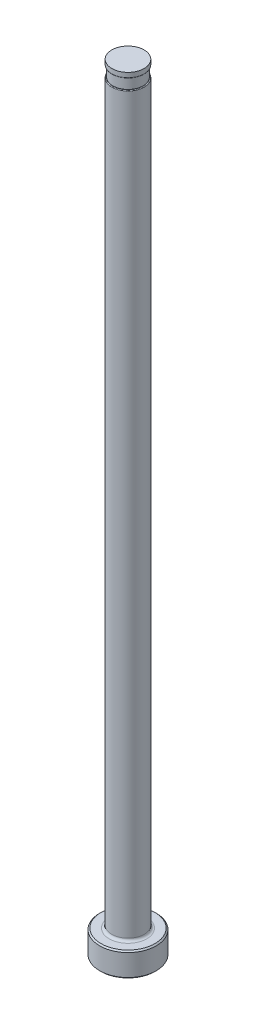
from build123d import *

# Parameters (mm, degrees)
CHAMFER1_SIZE     = 0.254
FILLET1_R         = 0.508
SKETCH2_W         = 0.2032
SKETCH2_H         = 2.032
D_SLOT_DEPTH      = 153.60197502
D_SLOT_DEPTH_BACK = 153.60197502
SKETCH5_W         = 0.00508
SKETCH5_H         = 1.016
FILLET2_R         = 0.127


with BuildPart() as part:
    # Sketch1 → Revolve1 (revolve)
    with BuildSketch(Plane.XY, mode=Mode.PRIVATE) as revolve1_sk:
        Polygon((0, 0), (-5.5499, 0), (-5.5499, 4.7498), (-3.175, 4.7498), (-3.175, 152.4), (0, 152.4), align=None)
    revolve(revolve1_sk.sketch.rotate(Axis((0, 259.958771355, 0), (0, -1, 0)), 270), axis=Axis((0, 259.958771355, 0), (0, -1, 0)))

    # Chamfer1
    chamfer1_edges = [part.edges().sort_by_distance(p)[0] for p in [
        (0, 4.7498, -5.5499),
        (0, 0, -5.5499),
    ]]
    chamfer(chamfer1_edges, length=CHAMFER1_SIZE)

    # Fillet1
    fillet1_edges = [part.edges().sort_by_distance(p)[0] for p in [
        (0, 4.7498, -3.175),
    ]]
    fillet(fillet1_edges, radius=FILLET1_R)

    # Sketch2 → Vent Relief (revolve, cut)
    with BuildSketch(Plane.XY, mode=Mode.PRIVATE) as vent_relief_sk:
        with Locations((-3.0734, 150.368)):
            Rectangle(SKETCH2_W, SKETCH2_H)
    revolve(vent_relief_sk.sketch.rotate(Axis((0, 153.448281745, 0), (0, -1, 0)), 270), axis=Axis((0, 153.448281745, 0), (0, -1, 0)), mode=Mode.SUBTRACT)

    # Sketch3 → D-Slot (cut, two sides: drawn at the far end of the back side and taken through both)
    with BuildSketch(Plane.XY.offset(-D_SLOT_DEPTH_BACK)):
        with BuildLine():
            Line((-2.9718, 150.368), (-2.9718, 86.868))
            ThreePointArc((-2.9718, 86.868), (-3.023013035, 86.300038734), (-3.175, 85.7504))
            Line((-3.175, 85.7504), (-3.175, 150.368))
            Line((-3.175, 150.368), (-2.9718, 150.368))
        make_face()
    extrude(amount=D_SLOT_DEPTH + D_SLOT_DEPTH_BACK, mode=Mode.SUBTRACT)

    # Sketch5 → Vent Diameter (revolve, cut)
    with BuildSketch(Plane.XY, mode=Mode.PRIVATE) as vent_diameter_sk:
        with Locations((-3.17246, 151.892)):
            Rectangle(SKETCH5_W, SKETCH5_H)
    revolve(vent_diameter_sk.sketch.rotate(Axis((0, 152.687735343, 0), (0, -1, 0)), 90), axis=Axis((0, 152.687735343, 0), (0, -1, 0)), mode=Mode.SUBTRACT)

    # Fillet2
    fillet2_edges = [part.edges().sort_by_distance(p)[0] for p in [
        (2.610460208, 149.352, -1.807241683),
        (0, 151.384, 3.16992),
    ]]
    fillet(fillet2_edges, radius=FILLET2_R)


solid = part.part
